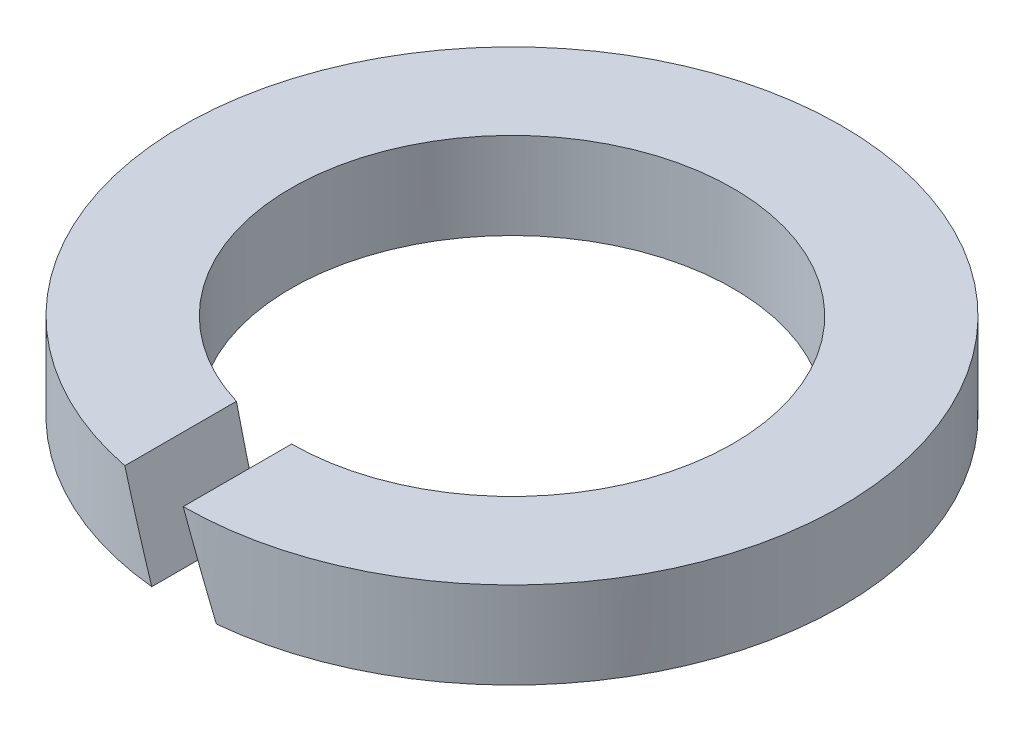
ISO-10303-21;
HEADER;
FILE_DESCRIPTION(('STEP AP214'),'2;1');
FILE_NAME('part.step','',(''),(''),'','','');
FILE_SCHEMA(('AUTOMOTIVE_DESIGN { 1 0 10303 214 1 1 1 1 }'));
ENDSEC;
DATA;
#1=APPLICATION_CONTEXT('core data for automotive mechanical design processes');
#2=APPLICATION_PROTOCOL_DEFINITION('international standard','automotive_design',2000,#1);
#3=PRODUCT_CONTEXT('',#1,'mechanical');
#4=PRODUCT('Part','Part','',(#3));
#5=PRODUCT_RELATED_PRODUCT_CATEGORY('part','',(#4));
#6=PRODUCT_DEFINITION_FORMATION('','',#4);
#7=PRODUCT_DEFINITION_CONTEXT('part definition',#1,'design');
#8=PRODUCT_DEFINITION('design','',#6,#7);
#9=PRODUCT_DEFINITION_SHAPE('','',#8);
#10=(LENGTH_UNIT() NAMED_UNIT(*) SI_UNIT(.MILLI.,.METRE.));
#11=(NAMED_UNIT(*) PLANE_ANGLE_UNIT() SI_UNIT($,.RADIAN.));
#12=(NAMED_UNIT(*) SI_UNIT($,.STERADIAN.) SOLID_ANGLE_UNIT());
#13=UNCERTAINTY_MEASURE_WITH_UNIT(LENGTH_MEASURE(1.E-05),#10,'distance_accuracy_value','');
#14=(GEOMETRIC_REPRESENTATION_CONTEXT(3) GLOBAL_UNCERTAINTY_ASSIGNED_CONTEXT((#13)) GLOBAL_UNIT_ASSIGNED_CONTEXT((#10,
#11,#12)) REPRESENTATION_CONTEXT('',''));
#15=CARTESIAN_POINT('',(0.,0.,0.));
#16=DIRECTION('',(0.,0.,1.));
#17=DIRECTION('',(1.,0.,0.));
#18=AXIS2_PLACEMENT_3D('',#15,#16,#17);
#19=CARTESIAN_POINT('',(0.,15.7596723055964,0.));
#20=DIRECTION('',(0.,1.,0.));
#21=DIRECTION('',(0.,0.,1.));
#22=AXIS2_PLACEMENT_3D('',#19,#20,#21);
#23=CYLINDRICAL_SURFACE('',#22,5.1);
#24=CARTESIAN_POINT('',(0.,0.,0.));
#25=DIRECTION('',(0.,1.,0.));
#26=DIRECTION('',(0.,0.,1.));
#27=AXIS2_PLACEMENT_3D('',#24,#25,#26);
#28=CIRCLE('',#27,5.1);
#29=CARTESIAN_POINT('',(0.744924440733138,0.,5.04530351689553));
#30=VERTEX_POINT('',#29);
#31=CARTESIAN_POINT('',(-0.744924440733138,0.,5.04530351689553));
#32=VERTEX_POINT('',#31);
#33=EDGE_CURVE('E89',#30,#32,#28,.T.);
#34=ORIENTED_EDGE('',*,*,#33,.F.);
#35=CARTESIAN_POINT('',(0.,2.04666308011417,0.));
#36=DIRECTION('',(-0.939692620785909,-0.342020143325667,0.));
#37=DIRECTION('',(-0.342020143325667,0.939692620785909,0.));
#38=AXIS2_PLACEMENT_3D('',#35,#36,#37);
#39=ELLIPSE('',#38,14.9114024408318,5.1);
#40=CARTESIAN_POINT('',(0.0169839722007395,2.,5.09997171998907));
#41=VERTEX_POINT('',#40);
#42=EDGE_CURVE('E54',#41,#30,#39,.F.);
#43=ORIENTED_EDGE('',*,*,#42,.F.);
#44=CARTESIAN_POINT('',(0.,2.,0.));
#45=DIRECTION('',(0.,1.,0.));
#46=DIRECTION('',(0.,0.,1.));
#47=AXIS2_PLACEMENT_3D('',#44,#45,#46);
#48=CIRCLE('',#47,5.1);
#49=CARTESIAN_POINT('',(-1.47286490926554,2.,4.88269074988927));
#50=VERTEX_POINT('',#49);
#51=EDGE_CURVE('E11',#41,#50,#48,.T.);
#52=ORIENTED_EDGE('',*,*,#51,.T.);
#53=CARTESIAN_POINT('',(0.,-2.04666308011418,0.));
#54=DIRECTION('',(0.939692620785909,0.342020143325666,0.));
#55=DIRECTION('',(-0.342020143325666,0.939692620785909,0.));
#56=AXIS2_PLACEMENT_3D('',#53,#54,#55);
#57=ELLIPSE('',#56,14.9114024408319,5.1);
#58=EDGE_CURVE('E86',#32,#50,#57,.F.);
#59=ORIENTED_EDGE('',*,*,#58,.F.);
#60=EDGE_LOOP('',(#34,#43,#52,#59));
#61=FACE_BOUND('',#60,.T.);
#62=ADVANCED_FACE('F32',(#61),#23,.F.);
#63=CARTESIAN_POINT('',(-5.1,2.,0.));
#64=DIRECTION('',(0.,1.,0.));
#65=DIRECTION('',(0.,0.,1.));
#66=AXIS2_PLACEMENT_3D('',#63,#64,#65);
#67=PLANE('',#66);
#68=ORIENTED_EDGE('',*,*,#51,.F.);
#69=DIRECTION('',(0.,0.,-1.));
#70=VECTOR('',#69,1.);
#71=CARTESIAN_POINT('',(0.0169839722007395,2.,7.601));
#72=LINE('',#71,#70);
#73=CARTESIAN_POINT('',(0.0169839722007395,2.,7.59998102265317));
#74=VERTEX_POINT('',#73);
#75=EDGE_CURVE('E91',#74,#41,#72,.T.);
#76=ORIENTED_EDGE('',*,*,#75,.F.);
#77=CARTESIAN_POINT('',(0.,2.,0.));
#78=DIRECTION('',(0.,1.,0.));
#79=DIRECTION('',(0.,0.,1.));
#80=AXIS2_PLACEMENT_3D('',#77,#78,#79);
#81=CIRCLE('',#80,7.6);
#82=CARTESIAN_POINT('',(-1.47286490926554,2.,7.45591503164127));
#83=VERTEX_POINT('',#82);
#84=EDGE_CURVE('E39',#74,#83,#81,.T.);
#85=ORIENTED_EDGE('',*,*,#84,.T.);
#86=DIRECTION('',(0.,0.,-1.));
#87=VECTOR('',#86,1.);
#88=CARTESIAN_POINT('',(-1.47286490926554,2.,7.601));
#89=LINE('',#88,#87);
#90=EDGE_CURVE('E95',#83,#50,#89,.T.);
#91=ORIENTED_EDGE('',*,*,#90,.T.);
#92=EDGE_LOOP('',(#68,#76,#85,#91));
#93=FACE_BOUND('',#92,.T.);
#94=ADVANCED_FACE('F106',(#93),#67,.T.);
#95=CARTESIAN_POINT('',(0.,15.7596723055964,0.));
#96=DIRECTION('',(0.,1.,0.));
#97=DIRECTION('',(0.,0.,1.));
#98=AXIS2_PLACEMENT_3D('',#95,#96,#97);
#99=CYLINDRICAL_SURFACE('',#98,7.6);
#100=ORIENTED_EDGE('',*,*,#84,.F.);
#101=CARTESIAN_POINT('',(0.,2.04666308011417,0.));
#102=DIRECTION('',(-0.939692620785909,-0.342020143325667,0.));
#103=DIRECTION('',(-0.342020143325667,0.939692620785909,0.));
#104=AXIS2_PLACEMENT_3D('',#101,#102,#103);
#105=ELLIPSE('',#104,22.2209134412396,7.6);
#106=CARTESIAN_POINT('',(0.744924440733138,0.,7.56340449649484));
#107=VERTEX_POINT('',#106);
#108=EDGE_CURVE('E72',#107,#74,#105,.T.);
#109=ORIENTED_EDGE('',*,*,#108,.F.);
#110=CARTESIAN_POINT('',(0.,0.,0.));
#111=DIRECTION('',(0.,1.,0.));
#112=DIRECTION('',(0.,0.,1.));
#113=AXIS2_PLACEMENT_3D('',#110,#111,#112);
#114=CIRCLE('',#113,7.6);
#115=CARTESIAN_POINT('',(-0.744924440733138,0.,7.56340449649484));
#116=VERTEX_POINT('',#115);
#117=EDGE_CURVE('E84',#107,#116,#114,.T.);
#118=ORIENTED_EDGE('',*,*,#117,.T.);
#119=CARTESIAN_POINT('',(0.,-2.04666308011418,0.));
#120=DIRECTION('',(0.939692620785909,0.342020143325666,0.));
#121=DIRECTION('',(-0.342020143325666,0.939692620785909,0.));
#122=AXIS2_PLACEMENT_3D('',#119,#120,#121);
#123=ELLIPSE('',#122,22.2209134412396,7.6);
#124=EDGE_CURVE('E46',#83,#116,#123,.T.);
#125=ORIENTED_EDGE('',*,*,#124,.F.);
#126=EDGE_LOOP('',(#100,#109,#118,#125));
#127=FACE_BOUND('',#126,.T.);
#128=ADVANCED_FACE('F83',(#127),#99,.T.);
#129=CARTESIAN_POINT('',(-5.1,0.,0.));
#130=DIRECTION('',(0.,-1.,0.));
#131=DIRECTION('',(0.,0.,-1.));
#132=AXIS2_PLACEMENT_3D('',#129,#130,#131);
#133=PLANE('',#132);
#134=ORIENTED_EDGE('',*,*,#117,.F.);
#135=DIRECTION('',(0.,0.,-1.));
#136=VECTOR('',#135,1.);
#137=CARTESIAN_POINT('',(0.744924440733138,0.,7.601));
#138=LINE('',#137,#136);
#139=EDGE_CURVE('E69',#107,#30,#138,.T.);
#140=ORIENTED_EDGE('',*,*,#139,.T.);
#141=ORIENTED_EDGE('',*,*,#33,.T.);
#142=DIRECTION('',(0.,0.,-1.));
#143=VECTOR('',#142,1.);
#144=CARTESIAN_POINT('',(-0.744924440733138,0.,7.601));
#145=LINE('',#144,#143);
#146=EDGE_CURVE('E78',#116,#32,#145,.T.);
#147=ORIENTED_EDGE('',*,*,#146,.F.);
#148=EDGE_LOOP('',(#134,#140,#141,#147));
#149=FACE_BOUND('',#148,.T.);
#150=ADVANCED_FACE('F88',(#149),#133,.T.);
#151=CARTESIAN_POINT('',(-1.47286490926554,2.,7.601));
#152=DIRECTION('',(0.939692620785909,0.342020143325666,0.));
#153=DIRECTION('',(-0.342020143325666,0.939692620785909,0.));
#154=AXIS2_PLACEMENT_3D('',#151,#152,#153);
#155=PLANE('',#154);
#156=ORIENTED_EDGE('',*,*,#58,.T.);
#157=ORIENTED_EDGE('',*,*,#90,.F.);
#158=ORIENTED_EDGE('',*,*,#124,.T.);
#159=ORIENTED_EDGE('',*,*,#146,.T.);
#160=EDGE_LOOP('',(#156,#157,#158,#159));
#161=FACE_BOUND('',#160,.T.);
#162=ADVANCED_FACE('F102',(#161),#155,.T.);
#163=CARTESIAN_POINT('',(0.0169839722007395,2.,7.601));
#164=DIRECTION('',(-0.939692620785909,-0.342020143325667,0.));
#165=DIRECTION('',(0.342020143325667,-0.939692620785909,0.));
#166=AXIS2_PLACEMENT_3D('',#163,#164,#165);
#167=PLANE('',#166);
#168=ORIENTED_EDGE('',*,*,#42,.T.);
#169=ORIENTED_EDGE('',*,*,#139,.F.);
#170=ORIENTED_EDGE('',*,*,#108,.T.);
#171=ORIENTED_EDGE('',*,*,#75,.T.);
#172=EDGE_LOOP('',(#168,#169,#170,#171));
#173=FACE_BOUND('',#172,.T.);
#174=ADVANCED_FACE('F71',(#173),#167,.T.);
#175=CLOSED_SHELL('',(#62,#94,#128,#150,#162,#174));
#176=MANIFOLD_SOLID_BREP('B2',#175);
#177=ADVANCED_BREP_SHAPE_REPRESENTATION('',(#18,#176),#14);
#178=SHAPE_DEFINITION_REPRESENTATION(#9,#177);
ENDSEC;
END-ISO-10303-21;
